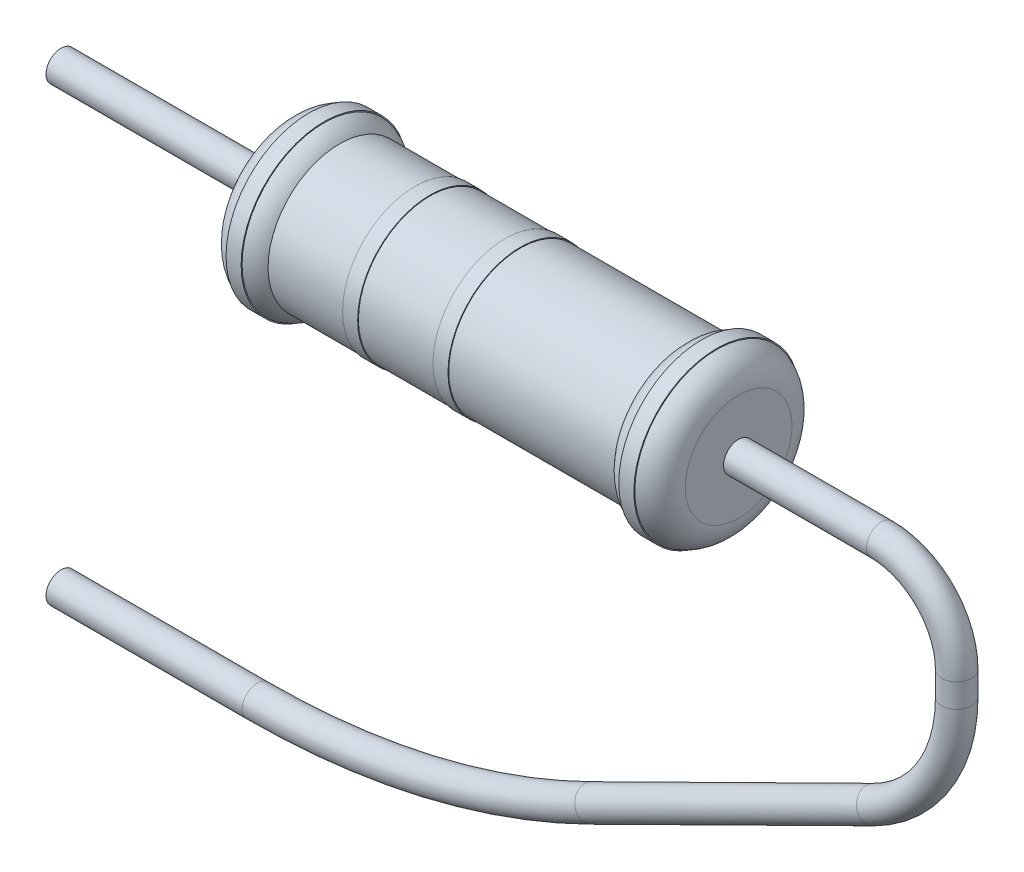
from build123d import *

# Parameters (mm, degrees)
ESQUISSE3_R = 0.2
ESQUISSE5_R = 0.2


with BuildPart() as part:
    # Esquisse1 → R_volution1 (revolve)
    with BuildSketch(Plane.XY, mode=Mode.PRIVATE) as r_volution1_sk:
        with BuildLine():
            Line((-3, 0), (3, 0))
            Line((3, 0), (3, 0.708257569))
            ThreePointArc((3, 0.708257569), (2.918609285, 0.947305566), (2.708257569, 1.087021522))
            Line((2.708257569, 1.087021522), (2.708257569, 1.1))
            Line((2.708257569, 1.1), (2.508257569, 1.1))
            Line((2.508257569, 1.1), (2.508257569, 1.087021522))
            ThreePointArc((2.508257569, 1.087021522), (2.392938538, 1.035518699), (2.3, 0.95))
            Line((2.3, 0.95), (0.1, 0.95))
            Line((0.1, 0.95), (0.1, 0.96))
            Line((0.1, 0.96), (-0.1, 0.96))
            Line((-0.1, 0.96), (-0.1, 0.95))
            Line((-0.1, 0.95), (-1.1, 0.95))
            Line((-1.1, 0.95), (-1.1, 0.96))
            Line((-1.1, 0.96), (-1.3, 0.96))
            Line((-1.3, 0.96), (-1.3, 0.95))
            Line((-1.3, 0.95), (-2.3, 0.95))
            ThreePointArc((-2.3, 0.95), (-2.392938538, 1.035518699), (-2.508257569, 1.087021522))
            Line((-2.508257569, 1.087021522), (-2.508257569, 1.1))
            Line((-2.508257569, 1.1), (-2.708257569, 1.1))
            Line((-2.708257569, 1.1), (-2.708257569, 1.087021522))
            ThreePointArc((-2.708257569, 1.087021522), (-2.918609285, 0.947305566), (-3, 0.708257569))
            Line((-3, 0.708257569), (-3, 0))
        make_face()
    revolve(r_volution1_sk.sketch.rotate(Axis((-9.420048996, 0, 0), (1, 0, 0)), 90), axis=Axis((-9.420048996, 0, 0), (1, 0, 0)))

    # Balayage1: sweep along a path in Esquisse2
    with BuildLine(Plane.XY) as balayage1_path:
        Line((-6, 0), (-3, 0))
    # Esquisse3 → Balayage1 (sweep)
    with BuildSketch(Plane.ZY.offset(3)):
        Circle(ESQUISSE3_R)
    sweep(path=balayage1_path.line)

    # Balayage2: sweep along a path in Esquisse4
    with BuildLine(Plane.XY) as balayage2_path:
        Line((-6, -6), (-3.39435099, -6))
        ThreePointArc((-3.39435099, -6), (-1.116373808, -5.737084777), (1.041820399, -4.962163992))
        Line((1.041820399, -4.962163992), (4.784937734, -3.109362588))
        ThreePointArc((4.784937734, -3.109362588), (5.596889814, -2.371806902), (5.897703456, -1.316929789))
        Line((5.897703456, -1.316929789), (5.897703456, -1))
        ThreePointArc((5.897703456, -1), (5.604810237, -0.292893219), (4.897703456, 0))
        Line((4.897703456, 0), (3, 0))
    # Esquisse5 → Balayage2 (sweep)
    with BuildSketch(Plane(origin=(3, 0, 0), x_dir=(0, 0, -1), z_dir=(1, 0, 0))):
        Circle(ESQUISSE5_R)
    sweep(path=balayage2_path.line)


solid = part.part
